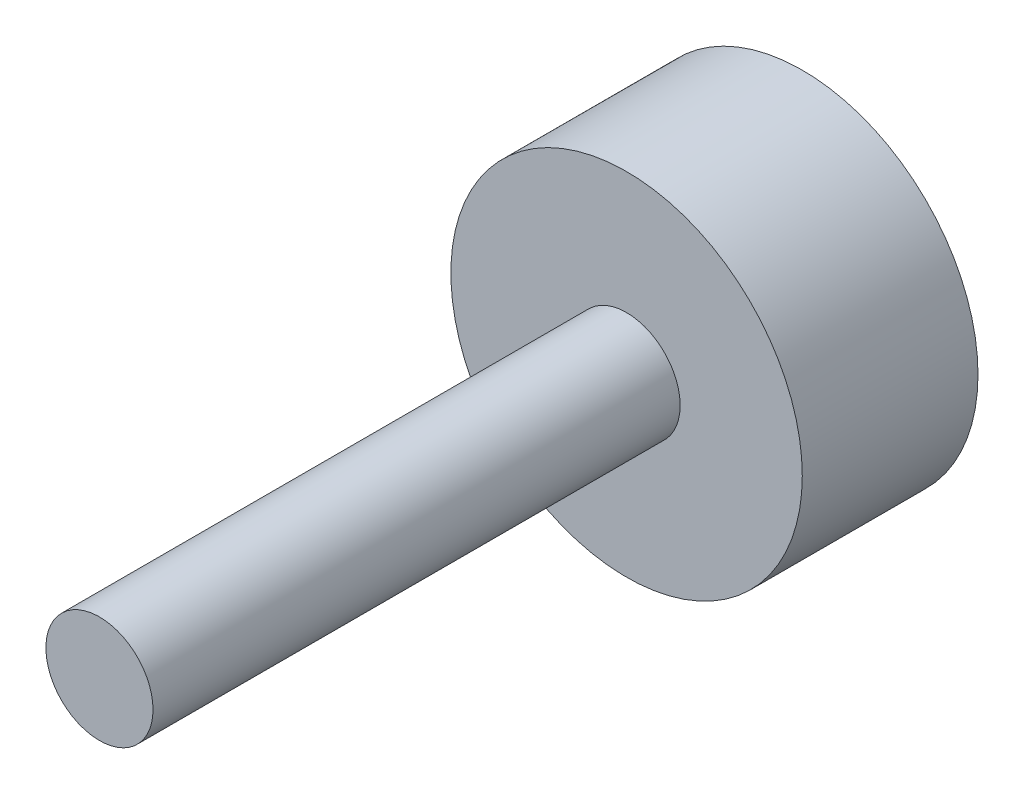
ISO-10303-21;
HEADER;
FILE_DESCRIPTION(('STEP AP214'),'2;1');
FILE_NAME('part.step','',(''),(''),'','','');
FILE_SCHEMA(('AUTOMOTIVE_DESIGN { 1 0 10303 214 1 1 1 1 }'));
ENDSEC;
DATA;
#1=APPLICATION_CONTEXT('core data for automotive mechanical design processes');
#2=APPLICATION_PROTOCOL_DEFINITION('international standard','automotive_design',2000,#1);
#3=PRODUCT_CONTEXT('',#1,'mechanical');
#4=PRODUCT('Part','Part','',(#3));
#5=PRODUCT_RELATED_PRODUCT_CATEGORY('part','',(#4));
#6=PRODUCT_DEFINITION_FORMATION('','',#4);
#7=PRODUCT_DEFINITION_CONTEXT('part definition',#1,'design');
#8=PRODUCT_DEFINITION('design','',#6,#7);
#9=PRODUCT_DEFINITION_SHAPE('','',#8);
#10=(LENGTH_UNIT() NAMED_UNIT(*) SI_UNIT(.MILLI.,.METRE.));
#11=(NAMED_UNIT(*) PLANE_ANGLE_UNIT() SI_UNIT($,.RADIAN.));
#12=(NAMED_UNIT(*) SI_UNIT($,.STERADIAN.) SOLID_ANGLE_UNIT());
#13=UNCERTAINTY_MEASURE_WITH_UNIT(LENGTH_MEASURE(1.E-05),#10,'distance_accuracy_value','');
#14=(GEOMETRIC_REPRESENTATION_CONTEXT(3) GLOBAL_UNCERTAINTY_ASSIGNED_CONTEXT((#13)) GLOBAL_UNIT_ASSIGNED_CONTEXT((#10,
#11,#12)) REPRESENTATION_CONTEXT('',''));
#15=CARTESIAN_POINT('',(0.,0.,0.));
#16=DIRECTION('',(0.,0.,1.));
#17=DIRECTION('',(1.,0.,0.));
#18=AXIS2_PLACEMENT_3D('',#15,#16,#17);
#19=CARTESIAN_POINT('',(0.,0.,5.));
#20=DIRECTION('',(0.,0.,-1.));
#21=DIRECTION('',(-1.,0.,0.));
#22=AXIS2_PLACEMENT_3D('',#19,#20,#21);
#23=CYLINDRICAL_SURFACE('',#22,5.);
#24=CARTESIAN_POINT('',(0.,0.,5.));
#25=DIRECTION('',(0.,0.,1.));
#26=DIRECTION('',(1.,0.,0.));
#27=AXIS2_PLACEMENT_3D('',#24,#25,#26);
#28=CIRCLE('',#27,5.);
#29=CARTESIAN_POINT('',(5.,0.,5.));
#30=VERTEX_POINT('',#29);
#31=EDGE_CURVE('E10',#30,#30,#28,.T.);
#32=ORIENTED_EDGE('',*,*,#31,.F.);
#33=EDGE_LOOP('',(#32));
#34=FACE_BOUND('',#33,.T.);
#35=CARTESIAN_POINT('',(0.,0.,0.));
#36=DIRECTION('',(0.,0.,1.));
#37=DIRECTION('',(1.,0.,0.));
#38=AXIS2_PLACEMENT_3D('',#35,#36,#37);
#39=CIRCLE('',#38,5.);
#40=CARTESIAN_POINT('',(5.,0.,0.));
#41=VERTEX_POINT('',#40);
#42=EDGE_CURVE('E33',#41,#41,#39,.T.);
#43=ORIENTED_EDGE('',*,*,#42,.T.);
#44=EDGE_LOOP('',(#43));
#45=FACE_BOUND('',#44,.T.);
#46=ADVANCED_FACE('F30',(#34,#45),#23,.T.);
#47=CARTESIAN_POINT('',(0.,0.,5.));
#48=DIRECTION('',(0.,0.,1.));
#49=DIRECTION('',(1.,0.,0.));
#50=AXIS2_PLACEMENT_3D('',#47,#48,#49);
#51=PLANE('',#50);
#52=CARTESIAN_POINT('',(0.,0.,5.));
#53=DIRECTION('',(0.,0.,1.));
#54=DIRECTION('',(1.,0.,0.));
#55=AXIS2_PLACEMENT_3D('',#52,#53,#54);
#56=CIRCLE('',#55,1.524);
#57=CARTESIAN_POINT('',(1.524,0.,5.));
#58=VERTEX_POINT('',#57);
#59=EDGE_CURVE('E42',#58,#58,#56,.T.);
#60=ORIENTED_EDGE('',*,*,#59,.F.);
#61=EDGE_LOOP('',(#60));
#62=FACE_BOUND('',#61,.T.);
#63=ORIENTED_EDGE('',*,*,#31,.T.);
#64=EDGE_LOOP('',(#63));
#65=FACE_BOUND('',#64,.T.);
#66=ADVANCED_FACE('F57',(#62,#65),#51,.T.);
#67=CARTESIAN_POINT('',(0.,0.,0.));
#68=DIRECTION('',(0.,0.,1.));
#69=DIRECTION('',(1.,0.,0.));
#70=AXIS2_PLACEMENT_3D('',#67,#68,#69);
#71=PLANE('',#70);
#72=ORIENTED_EDGE('',*,*,#42,.F.);
#73=EDGE_LOOP('',(#72));
#74=FACE_BOUND('',#73,.T.);
#75=ADVANCED_FACE('F53',(#74),#71,.F.);
#76=CARTESIAN_POINT('',(0.,0.,20.));
#77=DIRECTION('',(0.,0.,-1.));
#78=DIRECTION('',(-1.,0.,0.));
#79=AXIS2_PLACEMENT_3D('',#76,#77,#78);
#80=CYLINDRICAL_SURFACE('',#79,1.524);
#81=CARTESIAN_POINT('',(0.,0.,20.));
#82=DIRECTION('',(0.,0.,1.));
#83=DIRECTION('',(1.,0.,0.));
#84=AXIS2_PLACEMENT_3D('',#81,#82,#83);
#85=CIRCLE('',#84,1.524);
#86=CARTESIAN_POINT('',(1.524,0.,20.));
#87=VERTEX_POINT('',#86);
#88=EDGE_CURVE('E40',#87,#87,#85,.T.);
#89=ORIENTED_EDGE('',*,*,#88,.F.);
#90=EDGE_LOOP('',(#89));
#91=FACE_BOUND('',#90,.T.);
#92=ORIENTED_EDGE('',*,*,#59,.T.);
#93=EDGE_LOOP('',(#92));
#94=FACE_BOUND('',#93,.T.);
#95=ADVANCED_FACE('F50',(#91,#94),#80,.T.);
#96=CARTESIAN_POINT('',(0.,0.,20.));
#97=DIRECTION('',(0.,0.,1.));
#98=DIRECTION('',(1.,0.,0.));
#99=AXIS2_PLACEMENT_3D('',#96,#97,#98);
#100=PLANE('',#99);
#101=ORIENTED_EDGE('',*,*,#88,.T.);
#102=EDGE_LOOP('',(#101));
#103=FACE_BOUND('',#102,.T.);
#104=ADVANCED_FACE('F48',(#103),#100,.T.);
#105=CLOSED_SHELL('',(#46,#66,#75,#95,#104));
#106=MANIFOLD_SOLID_BREP('B2',#105);
#107=ADVANCED_BREP_SHAPE_REPRESENTATION('',(#18,#106),#14);
#108=SHAPE_DEFINITION_REPRESENTATION(#9,#107);
ENDSEC;
END-ISO-10303-21;
